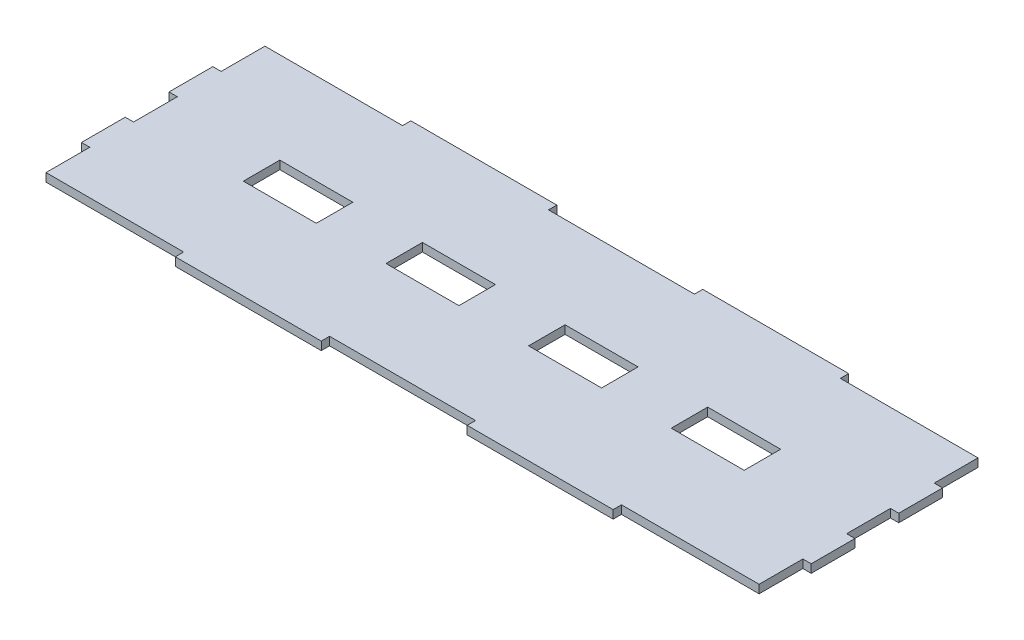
from build123d import *

# Parameters (mm, degrees)
BOSS_EXTRUDE3_DEPTH = 2.28
SKETCH2_W           = 20
SKETCH2_H           = 5
CUT_EXTRUDE1_DEPTH  = 10


with BuildPart() as part:
    # Sketch1 → Boss-Extrude3 (new body)
    with BuildSketch(Plane(origin=(0, 0, 0), x_dir=(1, 0, 0), z_dir=(0, 1, 0))):
        Polygon((20, 30), (-20, 30), (-20, 32.28), (-60, 32.28), (-60, 30), (-97.72, 30), (-97.72, 18), (-100, 18), (-100, 6), (-97.72, 6), (-97.72, -6), (-100, -6), (-100, -18), (-97.72, -18), (-97.72, -30), (-60, -30), (-60, -32.28), (-20, -32.28), (-20, -30), (20, -30), (20, -32.28), (60, -32.28), (60, -30), (97.72, -30), (97.72, -18), (100, -18), (100, -6), (97.72, -6), (97.72, 6), (100, 6), (100, 18), (97.72, 18), (97.72, 30), (60, 30), (60, 32.28), (20, 32.28), align=None)
    extrude(amount=BOSS_EXTRUDE3_DEPTH)

    # Sketch2 → Cut-Extrude1 (cut)
    with BuildSketch(Plane(origin=(0, 2.28, 0), x_dir=(1, 0, 0), z_dir=(0, 1, 0))):
        with Locations((58.632, -2.5)):
            Rectangle(SKETCH2_W, SKETCH2_H)
        with Locations((58.632, 2.5)):
            Rectangle(SKETCH2_W, SKETCH2_H)
        with Locations((19.544, -2.5)):
            Rectangle(SKETCH2_W, SKETCH2_H)
        with Locations((19.544, 2.5)):
            Rectangle(SKETCH2_W, SKETCH2_H)
        with Locations((-19.544, -2.5)):
            Rectangle(SKETCH2_W, SKETCH2_H)
        with Locations((-19.544, 2.5)):
            Rectangle(SKETCH2_W, SKETCH2_H)
        with Locations((-58.632, -2.5)):
            Rectangle(SKETCH2_W, SKETCH2_H)
        with Locations((-58.632, 2.5)):
            Rectangle(SKETCH2_W, SKETCH2_H)
    extrude(amount=-CUT_EXTRUDE1_DEPTH, mode=Mode.SUBTRACT)


solid = part.part
